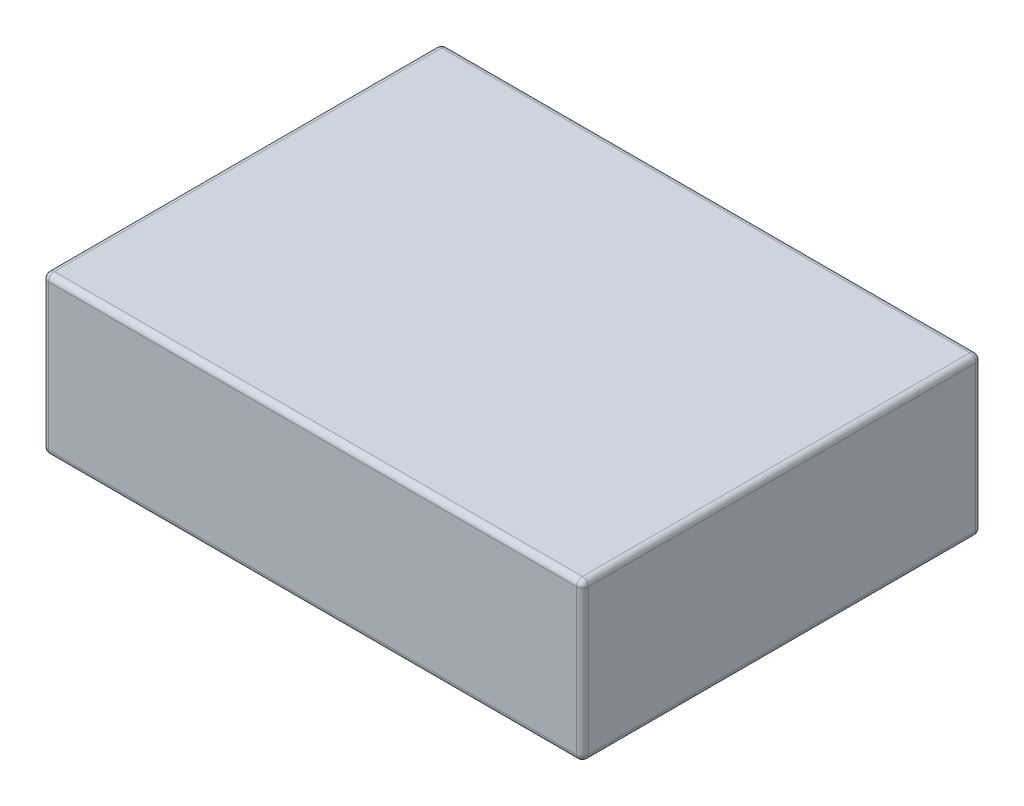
ISO-10303-21;
HEADER;
FILE_DESCRIPTION(('STEP AP214'),'2;1');
FILE_NAME('part.step','',(''),(''),'','','');
FILE_SCHEMA(('AUTOMOTIVE_DESIGN { 1 0 10303 214 1 1 1 1 }'));
ENDSEC;
DATA;
#1=APPLICATION_CONTEXT('core data for automotive mechanical design processes');
#2=APPLICATION_PROTOCOL_DEFINITION('international standard','automotive_design',2000,#1);
#3=PRODUCT_CONTEXT('',#1,'mechanical');
#4=PRODUCT('Part','Part','',(#3));
#5=PRODUCT_RELATED_PRODUCT_CATEGORY('part','',(#4));
#6=PRODUCT_DEFINITION_FORMATION('','',#4);
#7=PRODUCT_DEFINITION_CONTEXT('part definition',#1,'design');
#8=PRODUCT_DEFINITION('design','',#6,#7);
#9=PRODUCT_DEFINITION_SHAPE('','',#8);
#10=(LENGTH_UNIT() NAMED_UNIT(*) SI_UNIT(.MILLI.,.METRE.));
#11=(NAMED_UNIT(*) PLANE_ANGLE_UNIT() SI_UNIT($,.RADIAN.));
#12=(NAMED_UNIT(*) SI_UNIT($,.STERADIAN.) SOLID_ANGLE_UNIT());
#13=UNCERTAINTY_MEASURE_WITH_UNIT(LENGTH_MEASURE(1.E-05),#10,'distance_accuracy_value','');
#14=(GEOMETRIC_REPRESENTATION_CONTEXT(3) GLOBAL_UNCERTAINTY_ASSIGNED_CONTEXT((#13)) GLOBAL_UNIT_ASSIGNED_CONTEXT((#10,
#11,#12)) REPRESENTATION_CONTEXT('',''));
#15=CARTESIAN_POINT('',(0.,0.,0.));
#16=DIRECTION('',(0.,0.,1.));
#17=DIRECTION('',(1.,0.,0.));
#18=AXIS2_PLACEMENT_3D('',#15,#16,#17);
#19=CARTESIAN_POINT('',(0.,6.7,0.));
#20=DIRECTION('',(1.,0.,0.));
#21=DIRECTION('',(0.,0.,-1.));
#22=AXIS2_PLACEMENT_3D('',#19,#20,#21);
#23=PLANE('',#22);
#24=DIRECTION('',(0.,-1.,0.));
#25=VECTOR('',#24,1.);
#26=CARTESIAN_POINT('',(0.,6.7,-16.75));
#27=LINE('',#26,#25);
#28=CARTESIAN_POINT('',(0.,6.45,-16.75));
#29=VERTEX_POINT('',#28);
#30=CARTESIAN_POINT('',(0.,0.25,-16.75));
#31=VERTEX_POINT('',#30);
#32=EDGE_CURVE('E130',#29,#31,#27,.T.);
#33=ORIENTED_EDGE('',*,*,#32,.T.);
#34=DIRECTION('',(0.,0.,1.));
#35=VECTOR('',#34,1.);
#36=CARTESIAN_POINT('',(0.,0.25,0.));
#37=LINE('',#36,#35);
#38=CARTESIAN_POINT('',(0.,0.25,-0.25));
#39=VERTEX_POINT('',#38);
#40=EDGE_CURVE('E126',#31,#39,#37,.T.);
#41=ORIENTED_EDGE('',*,*,#40,.T.);
#42=DIRECTION('',(0.,-1.,0.));
#43=VECTOR('',#42,1.);
#44=CARTESIAN_POINT('',(0.,6.7,-0.25));
#45=LINE('',#44,#43);
#46=CARTESIAN_POINT('',(0.,6.45,-0.25));
#47=VERTEX_POINT('',#46);
#48=EDGE_CURVE('E121',#39,#47,#45,.F.);
#49=ORIENTED_EDGE('',*,*,#48,.T.);
#50=DIRECTION('',(0.,0.,1.));
#51=VECTOR('',#50,1.);
#52=CARTESIAN_POINT('',(0.,6.45,0.));
#53=LINE('',#52,#51);
#54=EDGE_CURVE('E123',#47,#29,#53,.F.);
#55=ORIENTED_EDGE('',*,*,#54,.T.);
#56=EDGE_LOOP('',(#33,#41,#49,#55));
#57=FACE_BOUND('',#56,.T.);
#58=ADVANCED_FACE('F32',(#57),#23,.F.);
#59=CARTESIAN_POINT('',(0.,6.7,0.));
#60=DIRECTION('',(0.,0.,-1.));
#61=DIRECTION('',(-1.,0.,0.));
#62=AXIS2_PLACEMENT_3D('',#59,#60,#61);
#63=PLANE('',#62);
#64=DIRECTION('',(1.,0.,0.));
#65=VECTOR('',#64,1.);
#66=CARTESIAN_POINT('',(23.,0.25,0.));
#67=LINE('',#66,#65);
#68=CARTESIAN_POINT('',(0.25,0.25,0.));
#69=VERTEX_POINT('',#68);
#70=CARTESIAN_POINT('',(22.75,0.25,0.));
#71=VERTEX_POINT('',#70);
#72=EDGE_CURVE('E226',#69,#71,#67,.T.);
#73=ORIENTED_EDGE('',*,*,#72,.T.);
#74=DIRECTION('',(0.,-1.,0.));
#75=VECTOR('',#74,1.);
#76=CARTESIAN_POINT('',(22.75,6.7,0.));
#77=LINE('',#76,#75);
#78=CARTESIAN_POINT('',(22.75,6.45,0.));
#79=VERTEX_POINT('',#78);
#80=EDGE_CURVE('E228',#71,#79,#77,.F.);
#81=ORIENTED_EDGE('',*,*,#80,.T.);
#82=DIRECTION('',(1.,0.,0.));
#83=VECTOR('',#82,1.);
#84=CARTESIAN_POINT('',(0.,6.45,0.));
#85=LINE('',#84,#83);
#86=CARTESIAN_POINT('',(0.25,6.45,0.));
#87=VERTEX_POINT('',#86);
#88=EDGE_CURVE('E219',#79,#87,#85,.F.);
#89=ORIENTED_EDGE('',*,*,#88,.T.);
#90=DIRECTION('',(0.,-1.,0.));
#91=VECTOR('',#90,1.);
#92=CARTESIAN_POINT('',(0.25,6.7,0.));
#93=LINE('',#92,#91);
#94=EDGE_CURVE('E151',#87,#69,#93,.T.);
#95=ORIENTED_EDGE('',*,*,#94,.T.);
#96=EDGE_LOOP('',(#73,#81,#89,#95));
#97=FACE_BOUND('',#96,.T.);
#98=ADVANCED_FACE('F320',(#97),#63,.F.);
#99=CARTESIAN_POINT('',(23.,6.7,0.));
#100=DIRECTION('',(-1.,0.,0.));
#101=DIRECTION('',(0.,0.,1.));
#102=AXIS2_PLACEMENT_3D('',#99,#100,#101);
#103=PLANE('',#102);
#104=DIRECTION('',(0.,0.,-1.));
#105=VECTOR('',#104,1.);
#106=CARTESIAN_POINT('',(23.,0.25,-17.));
#107=LINE('',#106,#105);
#108=CARTESIAN_POINT('',(23.,0.25,-0.25));
#109=VERTEX_POINT('',#108);
#110=CARTESIAN_POINT('',(23.,0.25,-16.75));
#111=VERTEX_POINT('',#110);
#112=EDGE_CURVE('E215',#109,#111,#107,.T.);
#113=ORIENTED_EDGE('',*,*,#112,.T.);
#114=DIRECTION('',(0.,-1.,0.));
#115=VECTOR('',#114,1.);
#116=CARTESIAN_POINT('',(23.,6.7,-16.75));
#117=LINE('',#116,#115);
#118=CARTESIAN_POINT('',(23.,6.45,-16.75));
#119=VERTEX_POINT('',#118);
#120=EDGE_CURVE('E212',#111,#119,#117,.F.);
#121=ORIENTED_EDGE('',*,*,#120,.T.);
#122=DIRECTION('',(0.,0.,-1.));
#123=VECTOR('',#122,1.);
#124=CARTESIAN_POINT('',(23.,6.45,0.));
#125=LINE('',#124,#123);
#126=CARTESIAN_POINT('',(23.,6.45,-0.25));
#127=VERTEX_POINT('',#126);
#128=EDGE_CURVE('E205',#119,#127,#125,.F.);
#129=ORIENTED_EDGE('',*,*,#128,.T.);
#130=DIRECTION('',(0.,-1.,0.));
#131=VECTOR('',#130,1.);
#132=CARTESIAN_POINT('',(23.,6.7,-0.25));
#133=LINE('',#132,#131);
#134=EDGE_CURVE('E208',#127,#109,#133,.T.);
#135=ORIENTED_EDGE('',*,*,#134,.T.);
#136=EDGE_LOOP('',(#113,#121,#129,#135));
#137=FACE_BOUND('',#136,.T.);
#138=ADVANCED_FACE('F213',(#137),#103,.F.);
#139=CARTESIAN_POINT('',(0.,6.7,-17.));
#140=DIRECTION('',(0.,0.,1.));
#141=DIRECTION('',(1.,0.,0.));
#142=AXIS2_PLACEMENT_3D('',#139,#140,#141);
#143=PLANE('',#142);
#144=DIRECTION('',(-1.,0.,0.));
#145=VECTOR('',#144,1.);
#146=CARTESIAN_POINT('',(0.,0.25,-17.));
#147=LINE('',#146,#145);
#148=CARTESIAN_POINT('',(22.75,0.25,-17.));
#149=VERTEX_POINT('',#148);
#150=CARTESIAN_POINT('',(0.25,0.25,-17.));
#151=VERTEX_POINT('',#150);
#152=EDGE_CURVE('E279',#149,#151,#147,.T.);
#153=ORIENTED_EDGE('',*,*,#152,.T.);
#154=DIRECTION('',(0.,-1.,0.));
#155=VECTOR('',#154,1.);
#156=CARTESIAN_POINT('',(0.25,6.7,-17.));
#157=LINE('',#156,#155);
#158=CARTESIAN_POINT('',(0.25,6.45,-17.));
#159=VERTEX_POINT('',#158);
#160=EDGE_CURVE('E209',#151,#159,#157,.F.);
#161=ORIENTED_EDGE('',*,*,#160,.T.);
#162=DIRECTION('',(-1.,0.,0.));
#163=VECTOR('',#162,1.);
#164=CARTESIAN_POINT('',(0.,6.45,-17.));
#165=LINE('',#164,#163);
#166=CARTESIAN_POINT('',(22.75,6.45,-17.));
#167=VERTEX_POINT('',#166);
#168=EDGE_CURVE('E272',#159,#167,#165,.F.);
#169=ORIENTED_EDGE('',*,*,#168,.T.);
#170=DIRECTION('',(0.,-1.,0.));
#171=VECTOR('',#170,1.);
#172=CARTESIAN_POINT('',(22.75,6.7,-17.));
#173=LINE('',#172,#171);
#174=EDGE_CURVE('E274',#167,#149,#173,.T.);
#175=ORIENTED_EDGE('',*,*,#174,.T.);
#176=EDGE_LOOP('',(#153,#161,#169,#175));
#177=FACE_BOUND('',#176,.T.);
#178=ADVANCED_FACE('F304',(#177),#143,.F.);
#179=CARTESIAN_POINT('',(0.,6.7,0.));
#180=DIRECTION('',(0.,-1.,0.));
#181=DIRECTION('',(0.,0.,-1.));
#182=AXIS2_PLACEMENT_3D('',#179,#180,#181);
#183=PLANE('',#182);
#184=DIRECTION('',(-1.,0.,0.));
#185=VECTOR('',#184,1.);
#186=CARTESIAN_POINT('',(0.,6.7,-16.75));
#187=LINE('',#186,#185);
#188=CARTESIAN_POINT('',(22.75,6.7,-16.75));
#189=VERTEX_POINT('',#188);
#190=CARTESIAN_POINT('',(0.25,6.7,-16.75));
#191=VERTEX_POINT('',#190);
#192=EDGE_CURVE('E41',#189,#191,#187,.T.);
#193=ORIENTED_EDGE('',*,*,#192,.T.);
#194=DIRECTION('',(0.,0.,1.));
#195=VECTOR('',#194,1.);
#196=CARTESIAN_POINT('',(0.25,6.7,0.));
#197=LINE('',#196,#195);
#198=CARTESIAN_POINT('',(0.25,6.7,-0.25));
#199=VERTEX_POINT('',#198);
#200=EDGE_CURVE('E11',#191,#199,#197,.T.);
#201=ORIENTED_EDGE('',*,*,#200,.T.);
#202=DIRECTION('',(1.,0.,0.));
#203=VECTOR('',#202,1.);
#204=CARTESIAN_POINT('',(0.,6.7,-0.25));
#205=LINE('',#204,#203);
#206=CARTESIAN_POINT('',(22.75,6.7,-0.25));
#207=VERTEX_POINT('',#206);
#208=EDGE_CURVE('E231',#199,#207,#205,.T.);
#209=ORIENTED_EDGE('',*,*,#208,.T.);
#210=DIRECTION('',(0.,0.,-1.));
#211=VECTOR('',#210,1.);
#212=CARTESIAN_POINT('',(22.75,6.7,0.));
#213=LINE('',#212,#211);
#214=EDGE_CURVE('E52',#207,#189,#213,.T.);
#215=ORIENTED_EDGE('',*,*,#214,.T.);
#216=EDGE_LOOP('',(#193,#201,#209,#215));
#217=FACE_BOUND('',#216,.T.);
#218=ADVANCED_FACE('F483',(#217),#183,.F.);
#219=CARTESIAN_POINT('',(0.,0.,0.));
#220=DIRECTION('',(0.,-1.,0.));
#221=DIRECTION('',(0.,0.,-1.));
#222=AXIS2_PLACEMENT_3D('',#219,#220,#221);
#223=PLANE('',#222);
#224=DIRECTION('',(1.,0.,0.));
#225=VECTOR('',#224,1.);
#226=CARTESIAN_POINT('',(0.,0.,-0.25));
#227=LINE('',#226,#225);
#228=CARTESIAN_POINT('',(22.75,0.,-0.25));
#229=VERTEX_POINT('',#228);
#230=CARTESIAN_POINT('',(0.25,0.,-0.25));
#231=VERTEX_POINT('',#230);
#232=EDGE_CURVE('E268',#229,#231,#227,.F.);
#233=ORIENTED_EDGE('',*,*,#232,.T.);
#234=DIRECTION('',(0.,0.,1.));
#235=VECTOR('',#234,1.);
#236=CARTESIAN_POINT('',(0.25,0.,-17.));
#237=LINE('',#236,#235);
#238=CARTESIAN_POINT('',(0.25,0.,-16.75));
#239=VERTEX_POINT('',#238);
#240=EDGE_CURVE('E262',#231,#239,#237,.F.);
#241=ORIENTED_EDGE('',*,*,#240,.T.);
#242=DIRECTION('',(-1.,0.,0.));
#243=VECTOR('',#242,1.);
#244=CARTESIAN_POINT('',(23.,0.,-16.75));
#245=LINE('',#244,#243);
#246=CARTESIAN_POINT('',(22.75,0.,-16.75));
#247=VERTEX_POINT('',#246);
#248=EDGE_CURVE('E256',#239,#247,#245,.F.);
#249=ORIENTED_EDGE('',*,*,#248,.T.);
#250=DIRECTION('',(0.,0.,-1.));
#251=VECTOR('',#250,1.);
#252=CARTESIAN_POINT('',(22.75,0.,0.));
#253=LINE('',#252,#251);
#254=EDGE_CURVE('E263',#247,#229,#253,.F.);
#255=ORIENTED_EDGE('',*,*,#254,.T.);
#256=EDGE_LOOP('',(#233,#241,#249,#255));
#257=FACE_BOUND('',#256,.T.);
#258=ADVANCED_FACE('F266',(#257),#223,.T.);
#259=CARTESIAN_POINT('',(22.75,6.45,0.));
#260=DIRECTION('',(0.,0.,-1.));
#261=DIRECTION('',(-1.,0.,0.));
#262=AXIS2_PLACEMENT_3D('',#259,#260,#261);
#263=CYLINDRICAL_SURFACE('',#262,0.25);
#264=CARTESIAN_POINT('',(22.75,6.45,-16.75));
#265=DIRECTION('',(0.,0.,-1.));
#266=DIRECTION('',(-1.,0.,0.));
#267=AXIS2_PLACEMENT_3D('',#264,#265,#266);
#268=CIRCLE('',#267,0.25);
#269=EDGE_CURVE('E36',#189,#119,#268,.T.);
#270=ORIENTED_EDGE('',*,*,#269,.F.);
#271=ORIENTED_EDGE('',*,*,#214,.F.);
#272=CARTESIAN_POINT('',(22.75,6.45,-0.25));
#273=DIRECTION('',(0.,0.,1.));
#274=DIRECTION('',(1.,0.,0.));
#275=AXIS2_PLACEMENT_3D('',#272,#273,#274);
#276=CIRCLE('',#275,0.25);
#277=EDGE_CURVE('E191',#127,#207,#276,.T.);
#278=ORIENTED_EDGE('',*,*,#277,.F.);
#279=ORIENTED_EDGE('',*,*,#128,.F.);
#280=EDGE_LOOP('',(#270,#271,#278,#279));
#281=FACE_BOUND('',#280,.T.);
#282=ADVANCED_FACE('F34',(#281),#263,.T.);
#283=CARTESIAN_POINT('',(22.75,6.45,-16.75));
#284=DIRECTION('',(0.,0.,1.));
#285=DIRECTION('',(1.,0.,0.));
#286=AXIS2_PLACEMENT_3D('',#283,#284,#285);
#287=SPHERICAL_SURFACE('',#286,0.25);
#288=CARTESIAN_POINT('',(22.75,6.45,-16.75));
#289=DIRECTION('',(1.,0.,0.));
#290=DIRECTION('',(0.,0.,-1.));
#291=AXIS2_PLACEMENT_3D('',#288,#289,#290);
#292=CIRCLE('',#291,0.25);
#293=EDGE_CURVE('E187',#189,#167,#292,.F.);
#294=ORIENTED_EDGE('',*,*,#293,.F.);
#295=ORIENTED_EDGE('',*,*,#269,.T.);
#296=CARTESIAN_POINT('',(22.75,6.45,-16.75));
#297=DIRECTION('',(0.,1.,0.));
#298=DIRECTION('',(0.,0.,1.));
#299=AXIS2_PLACEMENT_3D('',#296,#297,#298);
#300=CIRCLE('',#299,0.25);
#301=EDGE_CURVE('E190',#167,#119,#300,.F.);
#302=ORIENTED_EDGE('',*,*,#301,.F.);
#303=EDGE_LOOP('',(#294,#295,#302));
#304=FACE_BOUND('',#303,.T.);
#305=ADVANCED_FACE('F202',(#304),#287,.T.);
#306=CARTESIAN_POINT('',(22.75,6.45,-0.25));
#307=DIRECTION('',(0.,0.,1.));
#308=DIRECTION('',(1.,0.,0.));
#309=AXIS2_PLACEMENT_3D('',#306,#307,#308);
#310=SPHERICAL_SURFACE('',#309,0.25);
#311=CARTESIAN_POINT('',(22.75,6.45,-0.25));
#312=DIRECTION('',(0.,1.,0.));
#313=DIRECTION('',(0.,0.,1.));
#314=AXIS2_PLACEMENT_3D('',#311,#312,#313);
#315=CIRCLE('',#314,0.25);
#316=EDGE_CURVE('E181',#127,#79,#315,.F.);
#317=ORIENTED_EDGE('',*,*,#316,.F.);
#318=ORIENTED_EDGE('',*,*,#277,.T.);
#319=CARTESIAN_POINT('',(22.75,6.45,-0.25));
#320=DIRECTION('',(1.,0.,0.));
#321=DIRECTION('',(0.,0.,-1.));
#322=AXIS2_PLACEMENT_3D('',#319,#320,#321);
#323=CIRCLE('',#322,0.25);
#324=EDGE_CURVE('E184',#79,#207,#323,.F.);
#325=ORIENTED_EDGE('',*,*,#324,.F.);
#326=EDGE_LOOP('',(#317,#318,#325));
#327=FACE_BOUND('',#326,.T.);
#328=ADVANCED_FACE('F456',(#327),#310,.T.);
#329=CARTESIAN_POINT('',(22.75,6.7,-16.75));
#330=DIRECTION('',(0.,-1.,0.));
#331=DIRECTION('',(0.,0.,-1.));
#332=AXIS2_PLACEMENT_3D('',#329,#330,#331);
#333=CYLINDRICAL_SURFACE('',#332,0.25);
#334=ORIENTED_EDGE('',*,*,#301,.T.);
#335=ORIENTED_EDGE('',*,*,#120,.F.);
#336=CARTESIAN_POINT('',(22.75,0.25,-16.75));
#337=DIRECTION('',(0.,-1.,0.));
#338=DIRECTION('',(0.,0.,-1.));
#339=AXIS2_PLACEMENT_3D('',#336,#337,#338);
#340=CIRCLE('',#339,0.25);
#341=EDGE_CURVE('E175',#149,#111,#340,.T.);
#342=ORIENTED_EDGE('',*,*,#341,.F.);
#343=ORIENTED_EDGE('',*,*,#174,.F.);
#344=EDGE_LOOP('',(#334,#335,#342,#343));
#345=FACE_BOUND('',#344,.T.);
#346=ADVANCED_FACE('F306',(#345),#333,.T.);
#347=CARTESIAN_POINT('',(0.,6.45,-16.75));
#348=DIRECTION('',(-1.,0.,0.));
#349=DIRECTION('',(0.,0.,1.));
#350=AXIS2_PLACEMENT_3D('',#347,#348,#349);
#351=CYLINDRICAL_SURFACE('',#350,0.25);
#352=ORIENTED_EDGE('',*,*,#293,.T.);
#353=ORIENTED_EDGE('',*,*,#168,.F.);
#354=CARTESIAN_POINT('',(0.25,6.45,-16.75));
#355=DIRECTION('',(-1.,0.,0.));
#356=DIRECTION('',(0.,0.,1.));
#357=AXIS2_PLACEMENT_3D('',#354,#355,#356);
#358=CIRCLE('',#357,0.25);
#359=EDGE_CURVE('E172',#191,#159,#358,.T.);
#360=ORIENTED_EDGE('',*,*,#359,.F.);
#361=ORIENTED_EDGE('',*,*,#192,.F.);
#362=EDGE_LOOP('',(#352,#353,#360,#361));
#363=FACE_BOUND('',#362,.T.);
#364=ADVANCED_FACE('F440',(#363),#351,.T.);
#365=CARTESIAN_POINT('',(0.25,6.45,0.));
#366=DIRECTION('',(0.,0.,1.));
#367=DIRECTION('',(1.,0.,0.));
#368=AXIS2_PLACEMENT_3D('',#365,#366,#367);
#369=CYLINDRICAL_SURFACE('',#368,0.25);
#370=CARTESIAN_POINT('',(0.25,6.45,-0.25));
#371=DIRECTION('',(0.,0.,1.));
#372=DIRECTION('',(1.,0.,0.));
#373=AXIS2_PLACEMENT_3D('',#370,#371,#372);
#374=CIRCLE('',#373,0.25);
#375=EDGE_CURVE('E136',#199,#47,#374,.T.);
#376=ORIENTED_EDGE('',*,*,#375,.F.);
#377=ORIENTED_EDGE('',*,*,#200,.F.);
#378=CARTESIAN_POINT('',(0.25,6.45,-16.75));
#379=DIRECTION('',(0.,0.,-1.));
#380=DIRECTION('',(-1.,0.,0.));
#381=AXIS2_PLACEMENT_3D('',#378,#379,#380);
#382=CIRCLE('',#381,0.25);
#383=EDGE_CURVE('E139',#29,#191,#382,.T.);
#384=ORIENTED_EDGE('',*,*,#383,.F.);
#385=ORIENTED_EDGE('',*,*,#54,.F.);
#386=EDGE_LOOP('',(#376,#377,#384,#385));
#387=FACE_BOUND('',#386,.T.);
#388=ADVANCED_FACE('F135',(#387),#369,.T.);
#389=CARTESIAN_POINT('',(0.,6.45,-0.25));
#390=DIRECTION('',(1.,0.,0.));
#391=DIRECTION('',(0.,0.,-1.));
#392=AXIS2_PLACEMENT_3D('',#389,#390,#391);
#393=CYLINDRICAL_SURFACE('',#392,0.25);
#394=ORIENTED_EDGE('',*,*,#324,.T.);
#395=ORIENTED_EDGE('',*,*,#208,.F.);
#396=CARTESIAN_POINT('',(0.25,6.45,-0.25));
#397=DIRECTION('',(-1.,0.,0.));
#398=DIRECTION('',(0.,0.,1.));
#399=AXIS2_PLACEMENT_3D('',#396,#397,#398);
#400=CIRCLE('',#399,0.25);
#401=EDGE_CURVE('E148',#87,#199,#400,.T.);
#402=ORIENTED_EDGE('',*,*,#401,.F.);
#403=ORIENTED_EDGE('',*,*,#88,.F.);
#404=EDGE_LOOP('',(#394,#395,#402,#403));
#405=FACE_BOUND('',#404,.T.);
#406=ADVANCED_FACE('F424',(#405),#393,.T.);
#407=CARTESIAN_POINT('',(22.75,6.7,-0.25));
#408=DIRECTION('',(0.,-1.,0.));
#409=DIRECTION('',(0.,0.,-1.));
#410=AXIS2_PLACEMENT_3D('',#407,#408,#409);
#411=CYLINDRICAL_SURFACE('',#410,0.25);
#412=ORIENTED_EDGE('',*,*,#316,.T.);
#413=ORIENTED_EDGE('',*,*,#80,.F.);
#414=CARTESIAN_POINT('',(22.75,0.25,-0.25));
#415=DIRECTION('',(0.,-1.,0.));
#416=DIRECTION('',(0.,0.,-1.));
#417=AXIS2_PLACEMENT_3D('',#414,#415,#416);
#418=CIRCLE('',#417,0.25);
#419=EDGE_CURVE('E167',#109,#71,#418,.T.);
#420=ORIENTED_EDGE('',*,*,#419,.F.);
#421=ORIENTED_EDGE('',*,*,#134,.F.);
#422=EDGE_LOOP('',(#412,#413,#420,#421));
#423=FACE_BOUND('',#422,.T.);
#424=ADVANCED_FACE('F290',(#423),#411,.T.);
#425=CARTESIAN_POINT('',(22.75,0.25,0.));
#426=DIRECTION('',(0.,0.,1.));
#427=DIRECTION('',(1.,0.,0.));
#428=AXIS2_PLACEMENT_3D('',#425,#426,#427);
#429=CYLINDRICAL_SURFACE('',#428,0.25);
#430=CARTESIAN_POINT('',(22.75,0.25,-16.75));
#431=DIRECTION('',(0.,0.,-1.));
#432=DIRECTION('',(-1.,0.,0.));
#433=AXIS2_PLACEMENT_3D('',#430,#431,#432);
#434=CIRCLE('',#433,0.25);
#435=EDGE_CURVE('E178',#111,#247,#434,.T.);
#436=ORIENTED_EDGE('',*,*,#435,.F.);
#437=ORIENTED_EDGE('',*,*,#112,.F.);
#438=CARTESIAN_POINT('',(22.75,0.25,-0.25));
#439=DIRECTION('',(0.,0.,1.));
#440=DIRECTION('',(1.,0.,0.));
#441=AXIS2_PLACEMENT_3D('',#438,#439,#440);
#442=CIRCLE('',#441,0.25);
#443=EDGE_CURVE('E164',#229,#109,#442,.T.);
#444=ORIENTED_EDGE('',*,*,#443,.F.);
#445=ORIENTED_EDGE('',*,*,#254,.F.);
#446=EDGE_LOOP('',(#436,#437,#444,#445));
#447=FACE_BOUND('',#446,.T.);
#448=ADVANCED_FACE('F287',(#447),#429,.T.);
#449=CARTESIAN_POINT('',(22.75,0.25,-16.75));
#450=DIRECTION('',(0.,0.,1.));
#451=DIRECTION('',(1.,0.,0.));
#452=AXIS2_PLACEMENT_3D('',#449,#450,#451);
#453=SPHERICAL_SURFACE('',#452,0.25);
#454=ORIENTED_EDGE('',*,*,#341,.T.);
#455=ORIENTED_EDGE('',*,*,#435,.T.);
#456=CARTESIAN_POINT('',(22.75,0.25,-16.75));
#457=DIRECTION('',(1.,0.,0.));
#458=DIRECTION('',(0.,0.,-1.));
#459=AXIS2_PLACEMENT_3D('',#456,#457,#458);
#460=CIRCLE('',#459,0.25);
#461=EDGE_CURVE('E155',#149,#247,#460,.F.);
#462=ORIENTED_EDGE('',*,*,#461,.F.);
#463=EDGE_LOOP('',(#454,#455,#462));
#464=FACE_BOUND('',#463,.T.);
#465=ADVANCED_FACE('F308',(#464),#453,.T.);
#466=CARTESIAN_POINT('',(0.25,6.45,-16.75));
#467=DIRECTION('',(0.,0.,1.));
#468=DIRECTION('',(1.,0.,0.));
#469=AXIS2_PLACEMENT_3D('',#466,#467,#468);
#470=SPHERICAL_SURFACE('',#469,0.25);
#471=ORIENTED_EDGE('',*,*,#383,.T.);
#472=ORIENTED_EDGE('',*,*,#359,.T.);
#473=CARTESIAN_POINT('',(0.25,6.45,-16.75));
#474=DIRECTION('',(0.,1.,0.));
#475=DIRECTION('',(0.,0.,1.));
#476=AXIS2_PLACEMENT_3D('',#473,#474,#475);
#477=CIRCLE('',#476,0.25);
#478=EDGE_CURVE('E152',#29,#159,#477,.F.);
#479=ORIENTED_EDGE('',*,*,#478,.F.);
#480=EDGE_LOOP('',(#471,#472,#479));
#481=FACE_BOUND('',#480,.T.);
#482=ADVANCED_FACE('F310',(#481),#470,.T.);
#483=CARTESIAN_POINT('',(0.25,6.45,-0.25));
#484=DIRECTION('',(0.,0.,1.));
#485=DIRECTION('',(1.,0.,0.));
#486=AXIS2_PLACEMENT_3D('',#483,#484,#485);
#487=SPHERICAL_SURFACE('',#486,0.25);
#488=ORIENTED_EDGE('',*,*,#401,.T.);
#489=ORIENTED_EDGE('',*,*,#375,.T.);
#490=CARTESIAN_POINT('',(0.25,6.45,-0.25));
#491=DIRECTION('',(0.,1.,0.));
#492=DIRECTION('',(0.,0.,1.));
#493=AXIS2_PLACEMENT_3D('',#490,#491,#492);
#494=CIRCLE('',#493,0.25);
#495=EDGE_CURVE('E145',#87,#47,#494,.F.);
#496=ORIENTED_EDGE('',*,*,#495,.F.);
#497=EDGE_LOOP('',(#488,#489,#496));
#498=FACE_BOUND('',#497,.T.);
#499=ADVANCED_FACE('F144',(#498),#487,.T.);
#500=CARTESIAN_POINT('',(22.75,0.25,-0.25));
#501=DIRECTION('',(0.,0.,1.));
#502=DIRECTION('',(1.,0.,0.));
#503=AXIS2_PLACEMENT_3D('',#500,#501,#502);
#504=SPHERICAL_SURFACE('',#503,0.25);
#505=ORIENTED_EDGE('',*,*,#443,.T.);
#506=ORIENTED_EDGE('',*,*,#419,.T.);
#507=CARTESIAN_POINT('',(22.75,0.25,-0.25));
#508=DIRECTION('',(1.,0.,0.));
#509=DIRECTION('',(0.,0.,-1.));
#510=AXIS2_PLACEMENT_3D('',#507,#508,#509);
#511=CIRCLE('',#510,0.25);
#512=EDGE_CURVE('E153',#229,#71,#511,.F.);
#513=ORIENTED_EDGE('',*,*,#512,.F.);
#514=EDGE_LOOP('',(#505,#506,#513));
#515=FACE_BOUND('',#514,.T.);
#516=ADVANCED_FACE('F292',(#515),#504,.T.);
#517=CARTESIAN_POINT('',(0.,0.25,-16.75));
#518=DIRECTION('',(1.,0.,0.));
#519=DIRECTION('',(0.,0.,-1.));
#520=AXIS2_PLACEMENT_3D('',#517,#518,#519);
#521=CYLINDRICAL_SURFACE('',#520,0.25);
#522=ORIENTED_EDGE('',*,*,#461,.T.);
#523=ORIENTED_EDGE('',*,*,#248,.F.);
#524=CARTESIAN_POINT('',(0.25,0.25,-16.75));
#525=DIRECTION('',(-1.,0.,0.));
#526=DIRECTION('',(0.,0.,1.));
#527=AXIS2_PLACEMENT_3D('',#524,#525,#526);
#528=CIRCLE('',#527,0.25);
#529=EDGE_CURVE('E158',#151,#239,#528,.T.);
#530=ORIENTED_EDGE('',*,*,#529,.F.);
#531=ORIENTED_EDGE('',*,*,#152,.F.);
#532=EDGE_LOOP('',(#522,#523,#530,#531));
#533=FACE_BOUND('',#532,.T.);
#534=ADVANCED_FACE('F258',(#533),#521,.T.);
#535=CARTESIAN_POINT('',(0.25,6.7,-16.75));
#536=DIRECTION('',(0.,-1.,0.));
#537=DIRECTION('',(0.,0.,-1.));
#538=AXIS2_PLACEMENT_3D('',#535,#536,#537);
#539=CYLINDRICAL_SURFACE('',#538,0.25);
#540=ORIENTED_EDGE('',*,*,#478,.T.);
#541=ORIENTED_EDGE('',*,*,#160,.F.);
#542=CARTESIAN_POINT('',(0.25,0.25,-16.75));
#543=DIRECTION('',(0.,-1.,0.));
#544=DIRECTION('',(0.,0.,-1.));
#545=AXIS2_PLACEMENT_3D('',#542,#543,#544);
#546=CIRCLE('',#545,0.25);
#547=EDGE_CURVE('E245',#31,#151,#546,.T.);
#548=ORIENTED_EDGE('',*,*,#547,.F.);
#549=ORIENTED_EDGE('',*,*,#32,.F.);
#550=EDGE_LOOP('',(#540,#541,#548,#549));
#551=FACE_BOUND('',#550,.T.);
#552=ADVANCED_FACE('F302',(#551),#539,.T.);
#553=CARTESIAN_POINT('',(0.25,6.7,-0.25));
#554=DIRECTION('',(0.,-1.,0.));
#555=DIRECTION('',(0.,0.,-1.));
#556=AXIS2_PLACEMENT_3D('',#553,#554,#555);
#557=CYLINDRICAL_SURFACE('',#556,0.25);
#558=ORIENTED_EDGE('',*,*,#495,.T.);
#559=ORIENTED_EDGE('',*,*,#48,.F.);
#560=CARTESIAN_POINT('',(0.25,0.25,-0.25));
#561=DIRECTION('',(0.,-1.,0.));
#562=DIRECTION('',(0.,0.,-1.));
#563=AXIS2_PLACEMENT_3D('',#560,#561,#562);
#564=CIRCLE('',#563,0.25);
#565=EDGE_CURVE('E242',#69,#39,#564,.T.);
#566=ORIENTED_EDGE('',*,*,#565,.F.);
#567=ORIENTED_EDGE('',*,*,#94,.F.);
#568=EDGE_LOOP('',(#558,#559,#566,#567));
#569=FACE_BOUND('',#568,.T.);
#570=ADVANCED_FACE('F150',(#569),#557,.T.);
#571=CARTESIAN_POINT('',(0.,0.25,-0.25));
#572=DIRECTION('',(-1.,0.,0.));
#573=DIRECTION('',(0.,0.,1.));
#574=AXIS2_PLACEMENT_3D('',#571,#572,#573);
#575=CYLINDRICAL_SURFACE('',#574,0.25);
#576=ORIENTED_EDGE('',*,*,#512,.T.);
#577=ORIENTED_EDGE('',*,*,#72,.F.);
#578=CARTESIAN_POINT('',(0.25,0.25,-0.25));
#579=DIRECTION('',(-1.,0.,0.));
#580=DIRECTION('',(0.,0.,1.));
#581=AXIS2_PLACEMENT_3D('',#578,#579,#580);
#582=CIRCLE('',#581,0.25);
#583=EDGE_CURVE('E239',#231,#69,#582,.T.);
#584=ORIENTED_EDGE('',*,*,#583,.F.);
#585=ORIENTED_EDGE('',*,*,#232,.F.);
#586=EDGE_LOOP('',(#576,#577,#584,#585));
#587=FACE_BOUND('',#586,.T.);
#588=ADVANCED_FACE('F295',(#587),#575,.T.);
#589=CARTESIAN_POINT('',(0.25,0.25,-16.75));
#590=DIRECTION('',(0.,0.,1.));
#591=DIRECTION('',(1.,0.,0.));
#592=AXIS2_PLACEMENT_3D('',#589,#590,#591);
#593=SPHERICAL_SURFACE('',#592,0.25);
#594=ORIENTED_EDGE('',*,*,#547,.T.);
#595=ORIENTED_EDGE('',*,*,#529,.T.);
#596=CARTESIAN_POINT('',(0.25,0.25,-16.75));
#597=DIRECTION('',(0.,0.,-1.));
#598=DIRECTION('',(-1.,0.,0.));
#599=AXIS2_PLACEMENT_3D('',#596,#597,#598);
#600=CIRCLE('',#599,0.25);
#601=EDGE_CURVE('E237',#31,#239,#600,.F.);
#602=ORIENTED_EDGE('',*,*,#601,.F.);
#603=EDGE_LOOP('',(#594,#595,#602));
#604=FACE_BOUND('',#603,.T.);
#605=ADVANCED_FACE('F252',(#604),#593,.T.);
#606=CARTESIAN_POINT('',(0.25,0.25,-0.25));
#607=DIRECTION('',(0.,0.,1.));
#608=DIRECTION('',(1.,0.,0.));
#609=AXIS2_PLACEMENT_3D('',#606,#607,#608);
#610=SPHERICAL_SURFACE('',#609,0.25);
#611=ORIENTED_EDGE('',*,*,#583,.T.);
#612=ORIENTED_EDGE('',*,*,#565,.T.);
#613=CARTESIAN_POINT('',(0.25,0.25,-0.25));
#614=DIRECTION('',(0.,0.,1.));
#615=DIRECTION('',(1.,0.,0.));
#616=AXIS2_PLACEMENT_3D('',#613,#614,#615);
#617=CIRCLE('',#616,0.25);
#618=EDGE_CURVE('E235',#231,#39,#617,.F.);
#619=ORIENTED_EDGE('',*,*,#618,.F.);
#620=EDGE_LOOP('',(#611,#612,#619));
#621=FACE_BOUND('',#620,.T.);
#622=ADVANCED_FACE('F332',(#621),#610,.T.);
#623=CARTESIAN_POINT('',(0.25,0.25,0.));
#624=DIRECTION('',(0.,0.,-1.));
#625=DIRECTION('',(-1.,0.,0.));
#626=AXIS2_PLACEMENT_3D('',#623,#624,#625);
#627=CYLINDRICAL_SURFACE('',#626,0.25);
#628=ORIENTED_EDGE('',*,*,#601,.T.);
#629=ORIENTED_EDGE('',*,*,#240,.F.);
#630=ORIENTED_EDGE('',*,*,#618,.T.);
#631=ORIENTED_EDGE('',*,*,#40,.F.);
#632=EDGE_LOOP('',(#628,#629,#630,#631));
#633=FACE_BOUND('',#632,.T.);
#634=ADVANCED_FACE('F329',(#633),#627,.T.);
#635=CLOSED_SHELL('',(#58,#98,#138,#178,#218,#258,#282,#305,#328,#346,#364,#388,#406,#424,#448,
#465,#482,#499,#516,#534,#552,#570,#588,#605,#622,#634));
#636=MANIFOLD_SOLID_BREP('B2',#635);
#637=ADVANCED_BREP_SHAPE_REPRESENTATION('',(#18,#636),#14);
#638=SHAPE_DEFINITION_REPRESENTATION(#9,#637);
ENDSEC;
END-ISO-10303-21;
